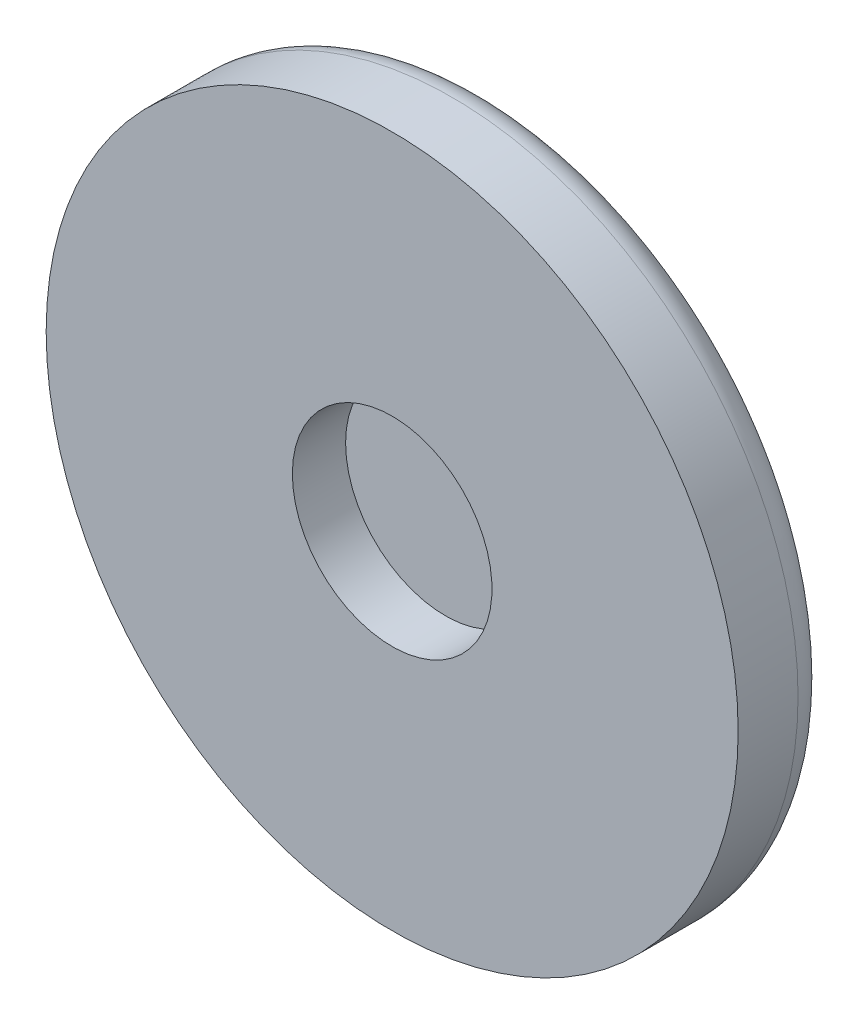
ISO-10303-21;
HEADER;
FILE_DESCRIPTION(('STEP AP214'),'2;1');
FILE_NAME('part.step','',(''),(''),'','','');
FILE_SCHEMA(('AUTOMOTIVE_DESIGN { 1 0 10303 214 1 1 1 1 }'));
ENDSEC;
DATA;
#1=APPLICATION_CONTEXT('core data for automotive mechanical design processes');
#2=APPLICATION_PROTOCOL_DEFINITION('international standard','automotive_design',2000,#1);
#3=PRODUCT_CONTEXT('',#1,'mechanical');
#4=PRODUCT('Part','Part','',(#3));
#5=PRODUCT_RELATED_PRODUCT_CATEGORY('part','',(#4));
#6=PRODUCT_DEFINITION_FORMATION('','',#4);
#7=PRODUCT_DEFINITION_CONTEXT('part definition',#1,'design');
#8=PRODUCT_DEFINITION('design','',#6,#7);
#9=PRODUCT_DEFINITION_SHAPE('','',#8);
#10=(LENGTH_UNIT() NAMED_UNIT(*) SI_UNIT(.MILLI.,.METRE.));
#11=(NAMED_UNIT(*) PLANE_ANGLE_UNIT() SI_UNIT($,.RADIAN.));
#12=(NAMED_UNIT(*) SI_UNIT($,.STERADIAN.) SOLID_ANGLE_UNIT());
#13=UNCERTAINTY_MEASURE_WITH_UNIT(LENGTH_MEASURE(1.E-05),#10,'distance_accuracy_value','');
#14=(GEOMETRIC_REPRESENTATION_CONTEXT(3) GLOBAL_UNCERTAINTY_ASSIGNED_CONTEXT((#13)) GLOBAL_UNIT_ASSIGNED_CONTEXT((#10,
#11,#12)) REPRESENTATION_CONTEXT('',''));
#15=CARTESIAN_POINT('',(0.,0.,0.));
#16=DIRECTION('',(0.,0.,1.));
#17=DIRECTION('',(1.,0.,0.));
#18=AXIS2_PLACEMENT_3D('',#15,#16,#17);
#19=CARTESIAN_POINT('',(0.,0.,0.));
#20=DIRECTION('',(0.,0.,-1.));
#21=DIRECTION('',(-1.,0.,0.));
#22=AXIS2_PLACEMENT_3D('',#19,#20,#21);
#23=PLANE('',#22);
#24=CARTESIAN_POINT('',(0.,0.,0.));
#25=DIRECTION('',(0.,0.,1.));
#26=DIRECTION('',(1.,0.,0.));
#27=AXIS2_PLACEMENT_3D('',#24,#25,#26);
#28=CIRCLE('',#27,23.5);
#29=CARTESIAN_POINT('',(23.5,0.,0.));
#30=VERTEX_POINT('',#29);
#31=EDGE_CURVE('E52',#30,#30,#28,.T.);
#32=ORIENTED_EDGE('',*,*,#31,.F.);
#33=EDGE_LOOP('',(#32));
#34=FACE_BOUND('',#33,.T.);
#35=ADVANCED_FACE('F13',(#34),#23,.T.);
#36=CARTESIAN_POINT('',(0.,0.,2.5));
#37=DIRECTION('',(0.,0.,-1.));
#38=DIRECTION('',(-1.,0.,0.));
#39=AXIS2_PLACEMENT_3D('',#36,#37,#38);
#40=TOROIDAL_SURFACE('',#39,23.5,2.5);
#41=ORIENTED_EDGE('',*,*,#31,.T.);
#42=EDGE_LOOP('',(#41));
#43=FACE_BOUND('',#42,.T.);
#44=CARTESIAN_POINT('',(0.,0.,2.5));
#45=DIRECTION('',(0.,0.,1.));
#46=DIRECTION('',(1.,0.,0.));
#47=AXIS2_PLACEMENT_3D('',#44,#45,#46);
#48=CIRCLE('',#47,26.);
#49=CARTESIAN_POINT('',(26.,0.,2.5));
#50=VERTEX_POINT('',#49);
#51=EDGE_CURVE('E60',#50,#50,#48,.T.);
#52=ORIENTED_EDGE('',*,*,#51,.F.);
#53=EDGE_LOOP('',(#52));
#54=FACE_BOUND('',#53,.T.);
#55=ADVANCED_FACE('F32',(#43,#54),#40,.T.);
#56=CARTESIAN_POINT('',(0.,0.,3.));
#57=DIRECTION('',(0.,0.,-1.));
#58=DIRECTION('',(-1.,0.,0.));
#59=AXIS2_PLACEMENT_3D('',#56,#57,#58);
#60=PLANE('',#59);
#61=CARTESIAN_POINT('',(0.,0.,3.));
#62=DIRECTION('',(0.,0.,-1.));
#63=DIRECTION('',(-1.,0.,0.));
#64=AXIS2_PLACEMENT_3D('',#61,#62,#63);
#65=CIRCLE('',#64,7.5);
#66=CARTESIAN_POINT('',(-7.5,0.,3.));
#67=VERTEX_POINT('',#66);
#68=EDGE_CURVE('E17',#67,#67,#65,.F.);
#69=ORIENTED_EDGE('',*,*,#68,.T.);
#70=EDGE_LOOP('',(#69));
#71=FACE_BOUND('',#70,.T.);
#72=ADVANCED_FACE('F42',(#71),#60,.F.);
#73=CARTESIAN_POINT('',(0.,0.,0.));
#74=DIRECTION('',(0.,0.,1.));
#75=DIRECTION('',(1.,0.,0.));
#76=AXIS2_PLACEMENT_3D('',#73,#74,#75);
#77=CYLINDRICAL_SURFACE('',#76,26.);
#78=ORIENTED_EDGE('',*,*,#51,.T.);
#79=EDGE_LOOP('',(#78));
#80=FACE_BOUND('',#79,.T.);
#81=CARTESIAN_POINT('',(0.,0.,7.));
#82=DIRECTION('',(0.,0.,1.));
#83=DIRECTION('',(1.,0.,0.));
#84=AXIS2_PLACEMENT_3D('',#81,#82,#83);
#85=CIRCLE('',#84,26.);
#86=CARTESIAN_POINT('',(26.,0.,7.));
#87=VERTEX_POINT('',#86);
#88=EDGE_CURVE('E21',#87,#87,#85,.F.);
#89=ORIENTED_EDGE('',*,*,#88,.T.);
#90=EDGE_LOOP('',(#89));
#91=FACE_BOUND('',#90,.T.);
#92=ADVANCED_FACE('F71',(#80,#91),#77,.T.);
#93=CARTESIAN_POINT('',(0.,0.,7.));
#94=DIRECTION('',(0.,0.,-1.));
#95=DIRECTION('',(-1.,0.,0.));
#96=AXIS2_PLACEMENT_3D('',#93,#94,#95);
#97=CYLINDRICAL_SURFACE('',#96,7.5);
#98=CARTESIAN_POINT('',(0.,0.,7.));
#99=DIRECTION('',(0.,0.,-1.));
#100=DIRECTION('',(-1.,0.,0.));
#101=AXIS2_PLACEMENT_3D('',#98,#99,#100);
#102=CIRCLE('',#101,7.5);
#103=CARTESIAN_POINT('',(-7.5,0.,7.));
#104=VERTEX_POINT('',#103);
#105=EDGE_CURVE('E9',#104,#104,#102,.F.);
#106=ORIENTED_EDGE('',*,*,#105,.T.);
#107=EDGE_LOOP('',(#106));
#108=FACE_BOUND('',#107,.T.);
#109=ORIENTED_EDGE('',*,*,#68,.F.);
#110=EDGE_LOOP('',(#109));
#111=FACE_BOUND('',#110,.T.);
#112=ADVANCED_FACE('F68',(#108,#111),#97,.F.);
#113=CARTESIAN_POINT('',(0.,0.,7.));
#114=DIRECTION('',(0.,0.,-1.));
#115=DIRECTION('',(-1.,0.,0.));
#116=AXIS2_PLACEMENT_3D('',#113,#114,#115);
#117=PLANE('',#116);
#118=ORIENTED_EDGE('',*,*,#105,.F.);
#119=EDGE_LOOP('',(#118));
#120=FACE_BOUND('',#119,.T.);
#121=ORIENTED_EDGE('',*,*,#88,.F.);
#122=EDGE_LOOP('',(#121));
#123=FACE_BOUND('',#122,.T.);
#124=ADVANCED_FACE('F70',(#120,#123),#117,.F.);
#125=CLOSED_SHELL('',(#35,#55,#72,#92,#112,#124));
#126=MANIFOLD_SOLID_BREP('B1',#125);
#127=ADVANCED_BREP_SHAPE_REPRESENTATION('',(#18,#126),#14);
#128=SHAPE_DEFINITION_REPRESENTATION(#9,#127);
ENDSEC;
END-ISO-10303-21;
